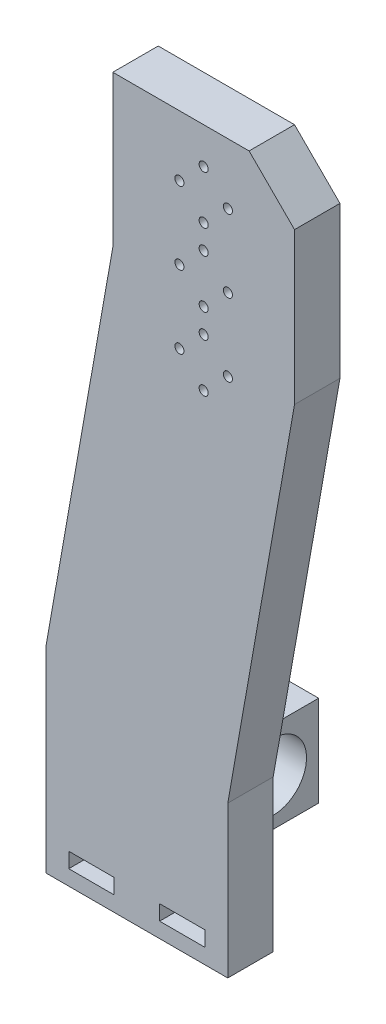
ISO-10303-21;
HEADER;
FILE_DESCRIPTION(('STEP AP214'),'2;1');
FILE_NAME('part.step','',(''),(''),'','','');
FILE_SCHEMA(('AUTOMOTIVE_DESIGN { 1 0 10303 214 1 1 1 1 }'));
ENDSEC;
DATA;
#1=APPLICATION_CONTEXT('core data for automotive mechanical design processes');
#2=APPLICATION_PROTOCOL_DEFINITION('international standard','automotive_design',2000,#1);
#3=PRODUCT_CONTEXT('',#1,'mechanical');
#4=PRODUCT('Part','Part','',(#3));
#5=PRODUCT_RELATED_PRODUCT_CATEGORY('part','',(#4));
#6=PRODUCT_DEFINITION_FORMATION('','',#4);
#7=PRODUCT_DEFINITION_CONTEXT('part definition',#1,'design');
#8=PRODUCT_DEFINITION('design','',#6,#7);
#9=PRODUCT_DEFINITION_SHAPE('','',#8);
#10=(LENGTH_UNIT() NAMED_UNIT(*) SI_UNIT(.MILLI.,.METRE.));
#11=(NAMED_UNIT(*) PLANE_ANGLE_UNIT() SI_UNIT($,.RADIAN.));
#12=(NAMED_UNIT(*) SI_UNIT($,.STERADIAN.) SOLID_ANGLE_UNIT());
#13=UNCERTAINTY_MEASURE_WITH_UNIT(LENGTH_MEASURE(1.E-05),#10,'distance_accuracy_value','');
#14=(GEOMETRIC_REPRESENTATION_CONTEXT(3) GLOBAL_UNCERTAINTY_ASSIGNED_CONTEXT((#13)) GLOBAL_UNIT_ASSIGNED_CONTEXT((#10,
#11,#12)) REPRESENTATION_CONTEXT('',''));
#15=CARTESIAN_POINT('',(0.,0.,0.));
#16=DIRECTION('',(0.,0.,1.));
#17=DIRECTION('',(1.,0.,0.));
#18=AXIS2_PLACEMENT_3D('',#15,#16,#17);
#19=CARTESIAN_POINT('',(0.,0.,0.));
#20=DIRECTION('',(0.,0.,1.));
#21=DIRECTION('',(1.,0.,0.));
#22=AXIS2_PLACEMENT_3D('',#19,#20,#21);
#23=PLANE('',#22);
#24=CARTESIAN_POINT('',(52.0408725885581,164.,0.));
#25=DIRECTION('',(0.,0.,1.));
#26=DIRECTION('',(1.,0.,0.));
#27=AXIS2_PLACEMENT_3D('',#24,#25,#26);
#28=CIRCLE('',#27,1.50000000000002);
#29=CARTESIAN_POINT('',(53.5408725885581,164.,0.));
#30=VERTEX_POINT('',#29);
#31=EDGE_CURVE('E207',#30,#30,#28,.T.);
#32=ORIENTED_EDGE('',*,*,#31,.T.);
#33=EDGE_LOOP('',(#32));
#34=FACE_BOUND('',#33,.T.);
#35=CARTESIAN_POINT('',(60.0408725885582,172.,0.));
#36=DIRECTION('',(0.,0.,1.));
#37=DIRECTION('',(1.,0.,0.));
#38=AXIS2_PLACEMENT_3D('',#35,#36,#37);
#39=CIRCLE('',#38,1.5);
#40=CARTESIAN_POINT('',(61.5408725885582,172.,0.));
#41=VERTEX_POINT('',#40);
#42=EDGE_CURVE('E217',#41,#41,#39,.T.);
#43=ORIENTED_EDGE('',*,*,#42,.T.);
#44=EDGE_LOOP('',(#43));
#45=FACE_BOUND('',#44,.T.);
#46=CARTESIAN_POINT('',(52.0408725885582,180.,0.));
#47=DIRECTION('',(0.,0.,1.));
#48=DIRECTION('',(1.,0.,0.));
#49=AXIS2_PLACEMENT_3D('',#46,#47,#48);
#50=CIRCLE('',#49,1.50000000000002);
#51=CARTESIAN_POINT('',(53.5408725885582,180.,0.));
#52=VERTEX_POINT('',#51);
#53=EDGE_CURVE('E222',#52,#52,#50,.T.);
#54=ORIENTED_EDGE('',*,*,#53,.T.);
#55=EDGE_LOOP('',(#54));
#56=FACE_BOUND('',#55,.T.);
#57=CARTESIAN_POINT('',(44.0408725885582,172.,0.));
#58=DIRECTION('',(0.,0.,1.));
#59=DIRECTION('',(1.,0.,0.));
#60=AXIS2_PLACEMENT_3D('',#57,#58,#59);
#61=CIRCLE('',#60,1.5);
#62=CARTESIAN_POINT('',(45.5408725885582,172.,0.));
#63=VERTEX_POINT('',#62);
#64=EDGE_CURVE('E228',#63,#63,#61,.T.);
#65=ORIENTED_EDGE('',*,*,#64,.T.);
#66=EDGE_LOOP('',(#65));
#67=FACE_BOUND('',#66,.T.);
#68=CARTESIAN_POINT('',(44.0408725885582,196.,0.));
#69=DIRECTION('',(0.,0.,1.));
#70=DIRECTION('',(-1.,0.,0.));
#71=AXIS2_PLACEMENT_3D('',#68,#69,#70);
#72=CIRCLE('',#71,1.5);
#73=CARTESIAN_POINT('',(42.5408725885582,196.,0.));
#74=VERTEX_POINT('',#73);
#75=EDGE_CURVE('E234',#74,#74,#72,.T.);
#76=ORIENTED_EDGE('',*,*,#75,.T.);
#77=EDGE_LOOP('',(#76));
#78=FACE_BOUND('',#77,.T.);
#79=CARTESIAN_POINT('',(52.0408725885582,188.,0.));
#80=DIRECTION('',(0.,0.,1.));
#81=DIRECTION('',(-1.,0.,0.));
#82=AXIS2_PLACEMENT_3D('',#79,#80,#81);
#83=CIRCLE('',#82,1.50000000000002);
#84=CARTESIAN_POINT('',(50.5408725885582,188.,0.));
#85=VERTEX_POINT('',#84);
#86=EDGE_CURVE('E240',#85,#85,#83,.T.);
#87=ORIENTED_EDGE('',*,*,#86,.T.);
#88=EDGE_LOOP('',(#87));
#89=FACE_BOUND('',#88,.T.);
#90=CARTESIAN_POINT('',(60.0408725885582,196.,0.));
#91=DIRECTION('',(0.,0.,1.));
#92=DIRECTION('',(-1.,0.,0.));
#93=AXIS2_PLACEMENT_3D('',#90,#91,#92);
#94=CIRCLE('',#93,1.5);
#95=CARTESIAN_POINT('',(58.5408725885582,196.,0.));
#96=VERTEX_POINT('',#95);
#97=EDGE_CURVE('E246',#96,#96,#94,.T.);
#98=ORIENTED_EDGE('',*,*,#97,.T.);
#99=EDGE_LOOP('',(#98));
#100=FACE_BOUND('',#99,.T.);
#101=CARTESIAN_POINT('',(52.0408725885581,212.,0.));
#102=DIRECTION('',(0.,0.,1.));
#103=DIRECTION('',(1.,0.,0.));
#104=AXIS2_PLACEMENT_3D('',#101,#102,#103);
#105=CIRCLE('',#104,1.50000000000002);
#106=CARTESIAN_POINT('',(53.5408725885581,212.,0.));
#107=VERTEX_POINT('',#106);
#108=EDGE_CURVE('E252',#107,#107,#105,.T.);
#109=ORIENTED_EDGE('',*,*,#108,.T.);
#110=EDGE_LOOP('',(#109));
#111=FACE_BOUND('',#110,.T.);
#112=DIRECTION('',(-1.,0.,0.));
#113=VECTOR('',#112,1.);
#114=CARTESIAN_POINT('',(52.5,10.,0.));
#115=LINE('',#114,#113);
#116=CARTESIAN_POINT('',(52.5,10.,0.));
#117=VERTEX_POINT('',#116);
#118=CARTESIAN_POINT('',(37.5,10.,0.));
#119=VERTEX_POINT('',#118);
#120=EDGE_CURVE('E258',#117,#119,#115,.T.);
#121=ORIENTED_EDGE('',*,*,#120,.T.);
#122=DIRECTION('',(0.,-1.,0.));
#123=VECTOR('',#122,1.);
#124=CARTESIAN_POINT('',(37.5,10.,0.));
#125=LINE('',#124,#123);
#126=CARTESIAN_POINT('',(37.5,5.,0.));
#127=VERTEX_POINT('',#126);
#128=EDGE_CURVE('E274',#119,#127,#125,.T.);
#129=ORIENTED_EDGE('',*,*,#128,.T.);
#130=DIRECTION('',(1.,0.,0.));
#131=VECTOR('',#130,1.);
#132=CARTESIAN_POINT('',(52.5,5.,0.));
#133=LINE('',#132,#131);
#134=CARTESIAN_POINT('',(52.5,5.,0.));
#135=VERTEX_POINT('',#134);
#136=EDGE_CURVE('E277',#127,#135,#133,.T.);
#137=ORIENTED_EDGE('',*,*,#136,.T.);
#138=DIRECTION('',(0.,1.,0.));
#139=VECTOR('',#138,1.);
#140=CARTESIAN_POINT('',(52.5,10.,0.));
#141=LINE('',#140,#139);
#142=EDGE_CURVE('E264',#135,#117,#141,.T.);
#143=ORIENTED_EDGE('',*,*,#142,.T.);
#144=EDGE_LOOP('',(#121,#129,#137,#143));
#145=FACE_BOUND('',#144,.T.);
#146=CARTESIAN_POINT('',(60.0408725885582,220.,0.));
#147=DIRECTION('',(0.,0.,1.));
#148=DIRECTION('',(1.,0.,0.));
#149=AXIS2_PLACEMENT_3D('',#146,#147,#148);
#150=CIRCLE('',#149,1.5);
#151=CARTESIAN_POINT('',(61.5408725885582,220.,0.));
#152=VERTEX_POINT('',#151);
#153=EDGE_CURVE('E322',#152,#152,#150,.T.);
#154=ORIENTED_EDGE('',*,*,#153,.T.);
#155=EDGE_LOOP('',(#154));
#156=FACE_BOUND('',#155,.T.);
#157=CARTESIAN_POINT('',(52.0408725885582,228.,0.));
#158=DIRECTION('',(0.,0.,1.));
#159=DIRECTION('',(1.,0.,0.));
#160=AXIS2_PLACEMENT_3D('',#157,#158,#159);
#161=CIRCLE('',#160,1.50000000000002);
#162=CARTESIAN_POINT('',(53.5408725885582,228.,0.));
#163=VERTEX_POINT('',#162);
#164=EDGE_CURVE('E326',#163,#163,#161,.T.);
#165=ORIENTED_EDGE('',*,*,#164,.T.);
#166=EDGE_LOOP('',(#165));
#167=FACE_BOUND('',#166,.T.);
#168=CARTESIAN_POINT('',(52.0408725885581,204.,0.));
#169=DIRECTION('',(0.,0.,1.));
#170=DIRECTION('',(-1.,0.,0.));
#171=AXIS2_PLACEMENT_3D('',#168,#169,#170);
#172=CIRCLE('',#171,1.50000000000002);
#173=CARTESIAN_POINT('',(50.5408725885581,204.,0.));
#174=VERTEX_POINT('',#173);
#175=EDGE_CURVE('E332',#174,#174,#172,.T.);
#176=ORIENTED_EDGE('',*,*,#175,.T.);
#177=EDGE_LOOP('',(#176));
#178=FACE_BOUND('',#177,.T.);
#179=CARTESIAN_POINT('',(44.0408725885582,220.,0.));
#180=DIRECTION('',(0.,0.,1.));
#181=DIRECTION('',(1.,0.,0.));
#182=AXIS2_PLACEMENT_3D('',#179,#180,#181);
#183=CIRCLE('',#182,1.5);
#184=CARTESIAN_POINT('',(45.5408725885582,220.,0.));
#185=VERTEX_POINT('',#184);
#186=EDGE_CURVE('E338',#185,#185,#183,.T.);
#187=ORIENTED_EDGE('',*,*,#186,.T.);
#188=EDGE_LOOP('',(#187));
#189=FACE_BOUND('',#188,.T.);
#190=DIRECTION('',(0.,-1.,0.));
#191=VECTOR('',#190,1.);
#192=CARTESIAN_POINT('',(0.,65.,0.));
#193=LINE('',#192,#191);
#194=CARTESIAN_POINT('',(0.,65.,0.));
#195=VERTEX_POINT('',#194);
#196=CARTESIAN_POINT('',(0.,0.,0.));
#197=VERTEX_POINT('',#196);
#198=EDGE_CURVE('E344',#195,#197,#193,.T.);
#199=ORIENTED_EDGE('',*,*,#198,.F.);
#200=DIRECTION('',(-0.173648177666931,-0.984807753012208,0.));
#201=VECTOR('',#200,1.);
#202=CARTESIAN_POINT('',(22.0408725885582,190.,0.));
#203=LINE('',#202,#201);
#204=CARTESIAN_POINT('',(22.0408725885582,190.,0.));
#205=VERTEX_POINT('',#204);
#206=EDGE_CURVE('E351',#205,#195,#203,.T.);
#207=ORIENTED_EDGE('',*,*,#206,.F.);
#208=DIRECTION('',(0.,-1.,0.));
#209=VECTOR('',#208,1.);
#210=CARTESIAN_POINT('',(22.0408725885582,240.,0.));
#211=LINE('',#210,#209);
#212=CARTESIAN_POINT('',(22.0408725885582,240.,0.));
#213=VERTEX_POINT('',#212);
#214=EDGE_CURVE('E382',#213,#205,#211,.T.);
#215=ORIENTED_EDGE('',*,*,#214,.F.);
#216=DIRECTION('',(-1.,0.,0.));
#217=VECTOR('',#216,1.);
#218=CARTESIAN_POINT('',(67.0408725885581,240.,0.));
#219=LINE('',#218,#217);
#220=CARTESIAN_POINT('',(67.0408725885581,240.,0.));
#221=VERTEX_POINT('',#220);
#222=EDGE_CURVE('E380',#221,#213,#219,.T.);
#223=ORIENTED_EDGE('',*,*,#222,.F.);
#224=DIRECTION('',(-0.707106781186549,0.707106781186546,0.));
#225=VECTOR('',#224,1.);
#226=CARTESIAN_POINT('',(82.0408725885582,225.,0.));
#227=LINE('',#226,#225);
#228=CARTESIAN_POINT('',(82.0408725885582,225.,0.));
#229=VERTEX_POINT('',#228);
#230=EDGE_CURVE('E378',#229,#221,#227,.T.);
#231=ORIENTED_EDGE('',*,*,#230,.F.);
#232=DIRECTION('',(0.,1.,0.));
#233=VECTOR('',#232,1.);
#234=CARTESIAN_POINT('',(82.0408725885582,175.,0.));
#235=LINE('',#234,#233);
#236=CARTESIAN_POINT('',(82.0408725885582,175.,0.));
#237=VERTEX_POINT('',#236);
#238=EDGE_CURVE('E376',#237,#229,#235,.T.);
#239=ORIENTED_EDGE('',*,*,#238,.F.);
#240=DIRECTION('',(0.173648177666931,0.984807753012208,0.));
#241=VECTOR('',#240,1.);
#242=CARTESIAN_POINT('',(60.,50.,0.));
#243=LINE('',#242,#241);
#244=CARTESIAN_POINT('',(60.,50.,0.));
#245=VERTEX_POINT('',#244);
#246=EDGE_CURVE('E374',#245,#237,#243,.T.);
#247=ORIENTED_EDGE('',*,*,#246,.F.);
#248=DIRECTION('',(0.,1.,0.));
#249=VECTOR('',#248,1.);
#250=CARTESIAN_POINT('',(60.,0.,0.));
#251=LINE('',#250,#249);
#252=CARTESIAN_POINT('',(60.,0.,0.));
#253=VERTEX_POINT('',#252);
#254=EDGE_CURVE('E372',#253,#245,#251,.T.);
#255=ORIENTED_EDGE('',*,*,#254,.F.);
#256=DIRECTION('',(1.,0.,0.));
#257=VECTOR('',#256,1.);
#258=CARTESIAN_POINT('',(0.,0.,0.));
#259=LINE('',#258,#257);
#260=EDGE_CURVE('E370',#197,#253,#259,.T.);
#261=ORIENTED_EDGE('',*,*,#260,.F.);
#262=EDGE_LOOP('',(#199,#207,#215,#223,#231,#239,#247,#255,#261));
#263=FACE_BOUND('',#262,.T.);
#264=DIRECTION('',(0.,-1.,0.));
#265=VECTOR('',#264,1.);
#266=CARTESIAN_POINT('',(7.50000000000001,10.,0.));
#267=LINE('',#266,#265);
#268=CARTESIAN_POINT('',(7.50000000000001,10.,0.));
#269=VERTEX_POINT('',#268);
#270=CARTESIAN_POINT('',(7.50000000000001,5.,0.));
#271=VERTEX_POINT('',#270);
#272=EDGE_CURVE('E291',#269,#271,#267,.T.);
#273=ORIENTED_EDGE('',*,*,#272,.T.);
#274=DIRECTION('',(1.,0.,0.));
#275=VECTOR('',#274,1.);
#276=CARTESIAN_POINT('',(7.50000000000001,5.,0.));
#277=LINE('',#276,#275);
#278=CARTESIAN_POINT('',(22.5,5.,0.));
#279=VERTEX_POINT('',#278);
#280=EDGE_CURVE('E305',#271,#279,#277,.T.);
#281=ORIENTED_EDGE('',*,*,#280,.T.);
#282=DIRECTION('',(0.,1.,0.));
#283=VECTOR('',#282,1.);
#284=CARTESIAN_POINT('',(22.5,10.,0.));
#285=LINE('',#284,#283);
#286=CARTESIAN_POINT('',(22.5,10.,0.));
#287=VERTEX_POINT('',#286);
#288=EDGE_CURVE('E308',#279,#287,#285,.T.);
#289=ORIENTED_EDGE('',*,*,#288,.T.);
#290=DIRECTION('',(-1.,0.,0.));
#291=VECTOR('',#290,1.);
#292=CARTESIAN_POINT('',(7.50000000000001,10.,0.));
#293=LINE('',#292,#291);
#294=EDGE_CURVE('E295',#287,#269,#293,.T.);
#295=ORIENTED_EDGE('',*,*,#294,.T.);
#296=EDGE_LOOP('',(#273,#281,#289,#295));
#297=FACE_BOUND('',#296,.T.);
#298=DIRECTION('',(0.,-1.,0.));
#299=VECTOR('',#298,1.);
#300=CARTESIAN_POINT('',(45.,50.,0.));
#301=LINE('',#300,#299);
#302=CARTESIAN_POINT('',(45.,50.,0.));
#303=VERTEX_POINT('',#302);
#304=CARTESIAN_POINT('',(45.,20.,0.));
#305=VERTEX_POINT('',#304);
#306=EDGE_CURVE('E206',#303,#305,#301,.T.);
#307=ORIENTED_EDGE('',*,*,#306,.F.);
#308=DIRECTION('',(1.,0.,0.));
#309=VECTOR('',#308,1.);
#310=CARTESIAN_POINT('',(45.,50.,0.));
#311=LINE('',#310,#309);
#312=CARTESIAN_POINT('',(15.,50.,0.));
#313=VERTEX_POINT('',#312);
#314=EDGE_CURVE('E203',#313,#303,#311,.T.);
#315=ORIENTED_EDGE('',*,*,#314,.F.);
#316=DIRECTION('',(0.,1.,0.));
#317=VECTOR('',#316,1.);
#318=CARTESIAN_POINT('',(15.,50.,0.));
#319=LINE('',#318,#317);
#320=CARTESIAN_POINT('',(15.,20.,0.));
#321=VERTEX_POINT('',#320);
#322=EDGE_CURVE('E63',#321,#313,#319,.T.);
#323=ORIENTED_EDGE('',*,*,#322,.F.);
#324=DIRECTION('',(-1.,0.,0.));
#325=VECTOR('',#324,1.);
#326=CARTESIAN_POINT('',(45.,20.,0.));
#327=LINE('',#326,#325);
#328=EDGE_CURVE('E58',#305,#321,#327,.T.);
#329=ORIENTED_EDGE('',*,*,#328,.F.);
#330=EDGE_LOOP('',(#307,#315,#323,#329));
#331=FACE_BOUND('',#330,.T.);
#332=ADVANCED_FACE('F43',(#34,#45,#56,#67,#78,#89,#100,#111,#145,#156,#167,#178,#189,#263,#297,
#331),#23,.F.);
#333=CARTESIAN_POINT('',(0.,0.,15.));
#334=DIRECTION('',(0.,0.,1.));
#335=DIRECTION('',(1.,0.,0.));
#336=AXIS2_PLACEMENT_3D('',#333,#334,#335);
#337=PLANE('',#336);
#338=CARTESIAN_POINT('',(60.0408725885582,172.,15.));
#339=DIRECTION('',(0.,0.,1.));
#340=DIRECTION('',(1.,0.,0.));
#341=AXIS2_PLACEMENT_3D('',#338,#339,#340);
#342=CIRCLE('',#341,1.5);
#343=CARTESIAN_POINT('',(61.5408725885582,172.,15.));
#344=VERTEX_POINT('',#343);
#345=EDGE_CURVE('E219',#344,#344,#342,.T.);
#346=ORIENTED_EDGE('',*,*,#345,.F.);
#347=EDGE_LOOP('',(#346));
#348=FACE_BOUND('',#347,.T.);
#349=CARTESIAN_POINT('',(44.0408725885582,172.,15.));
#350=DIRECTION('',(0.,0.,1.));
#351=DIRECTION('',(1.,0.,0.));
#352=AXIS2_PLACEMENT_3D('',#349,#350,#351);
#353=CIRCLE('',#352,1.5);
#354=CARTESIAN_POINT('',(45.5408725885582,172.,15.));
#355=VERTEX_POINT('',#354);
#356=EDGE_CURVE('E231',#355,#355,#353,.T.);
#357=ORIENTED_EDGE('',*,*,#356,.F.);
#358=EDGE_LOOP('',(#357));
#359=FACE_BOUND('',#358,.T.);
#360=CARTESIAN_POINT('',(52.0408725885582,188.,15.));
#361=DIRECTION('',(0.,0.,1.));
#362=DIRECTION('',(-1.,0.,0.));
#363=AXIS2_PLACEMENT_3D('',#360,#361,#362);
#364=CIRCLE('',#363,1.50000000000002);
#365=CARTESIAN_POINT('',(50.5408725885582,188.,15.));
#366=VERTEX_POINT('',#365);
#367=EDGE_CURVE('E243',#366,#366,#364,.T.);
#368=ORIENTED_EDGE('',*,*,#367,.F.);
#369=EDGE_LOOP('',(#368));
#370=FACE_BOUND('',#369,.T.);
#371=CARTESIAN_POINT('',(52.0408725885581,212.,15.));
#372=DIRECTION('',(0.,0.,1.));
#373=DIRECTION('',(1.,0.,0.));
#374=AXIS2_PLACEMENT_3D('',#371,#372,#373);
#375=CIRCLE('',#374,1.50000000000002);
#376=CARTESIAN_POINT('',(53.5408725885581,212.,15.));
#377=VERTEX_POINT('',#376);
#378=EDGE_CURVE('E255',#377,#377,#375,.T.);
#379=ORIENTED_EDGE('',*,*,#378,.F.);
#380=EDGE_LOOP('',(#379));
#381=FACE_BOUND('',#380,.T.);
#382=CARTESIAN_POINT('',(52.0408725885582,228.,15.));
#383=DIRECTION('',(0.,0.,1.));
#384=DIRECTION('',(1.,0.,0.));
#385=AXIS2_PLACEMENT_3D('',#382,#383,#384);
#386=CIRCLE('',#385,1.50000000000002);
#387=CARTESIAN_POINT('',(53.5408725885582,228.,15.));
#388=VERTEX_POINT('',#387);
#389=EDGE_CURVE('E329',#388,#388,#386,.T.);
#390=ORIENTED_EDGE('',*,*,#389,.F.);
#391=EDGE_LOOP('',(#390));
#392=FACE_BOUND('',#391,.T.);
#393=CARTESIAN_POINT('',(44.0408725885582,220.,15.));
#394=DIRECTION('',(0.,0.,1.));
#395=DIRECTION('',(1.,0.,0.));
#396=AXIS2_PLACEMENT_3D('',#393,#394,#395);
#397=CIRCLE('',#396,1.5);
#398=CARTESIAN_POINT('',(45.5408725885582,220.,15.));
#399=VERTEX_POINT('',#398);
#400=EDGE_CURVE('E341',#399,#399,#397,.T.);
#401=ORIENTED_EDGE('',*,*,#400,.F.);
#402=EDGE_LOOP('',(#401));
#403=FACE_BOUND('',#402,.T.);
#404=DIRECTION('',(0.,-1.,0.));
#405=VECTOR('',#404,1.);
#406=CARTESIAN_POINT('',(0.,65.,15.));
#407=LINE('',#406,#405);
#408=CARTESIAN_POINT('',(0.,65.,15.));
#409=VERTEX_POINT('',#408);
#410=CARTESIAN_POINT('',(0.,0.,15.));
#411=VERTEX_POINT('',#410);
#412=EDGE_CURVE('E347',#409,#411,#407,.T.);
#413=ORIENTED_EDGE('',*,*,#412,.T.);
#414=DIRECTION('',(1.,0.,0.));
#415=VECTOR('',#414,1.);
#416=CARTESIAN_POINT('',(0.,0.,15.));
#417=LINE('',#416,#415);
#418=CARTESIAN_POINT('',(60.,0.,15.));
#419=VERTEX_POINT('',#418);
#420=EDGE_CURVE('E350',#411,#419,#417,.T.);
#421=ORIENTED_EDGE('',*,*,#420,.T.);
#422=DIRECTION('',(0.,1.,0.));
#423=VECTOR('',#422,1.);
#424=CARTESIAN_POINT('',(60.,0.,15.));
#425=LINE('',#424,#423);
#426=CARTESIAN_POINT('',(60.,50.,15.));
#427=VERTEX_POINT('',#426);
#428=EDGE_CURVE('E353',#419,#427,#425,.T.);
#429=ORIENTED_EDGE('',*,*,#428,.T.);
#430=DIRECTION('',(0.173648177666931,0.984807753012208,0.));
#431=VECTOR('',#430,1.);
#432=CARTESIAN_POINT('',(60.,50.,15.));
#433=LINE('',#432,#431);
#434=CARTESIAN_POINT('',(82.0408725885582,175.,15.));
#435=VERTEX_POINT('',#434);
#436=EDGE_CURVE('E355',#427,#435,#433,.T.);
#437=ORIENTED_EDGE('',*,*,#436,.T.);
#438=DIRECTION('',(0.,1.,0.));
#439=VECTOR('',#438,1.);
#440=CARTESIAN_POINT('',(82.0408725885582,175.,15.));
#441=LINE('',#440,#439);
#442=CARTESIAN_POINT('',(82.0408725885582,225.,15.));
#443=VERTEX_POINT('',#442);
#444=EDGE_CURVE('E357',#435,#443,#441,.T.);
#445=ORIENTED_EDGE('',*,*,#444,.T.);
#446=DIRECTION('',(-0.707106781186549,0.707106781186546,0.));
#447=VECTOR('',#446,1.);
#448=CARTESIAN_POINT('',(82.0408725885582,225.,15.));
#449=LINE('',#448,#447);
#450=CARTESIAN_POINT('',(67.0408725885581,240.,15.));
#451=VERTEX_POINT('',#450);
#452=EDGE_CURVE('E359',#443,#451,#449,.T.);
#453=ORIENTED_EDGE('',*,*,#452,.T.);
#454=DIRECTION('',(-1.,0.,0.));
#455=VECTOR('',#454,1.);
#456=CARTESIAN_POINT('',(67.0408725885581,240.,15.));
#457=LINE('',#456,#455);
#458=CARTESIAN_POINT('',(22.0408725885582,240.,15.));
#459=VERTEX_POINT('',#458);
#460=EDGE_CURVE('E361',#451,#459,#457,.T.);
#461=ORIENTED_EDGE('',*,*,#460,.T.);
#462=DIRECTION('',(0.,-1.,0.));
#463=VECTOR('',#462,1.);
#464=CARTESIAN_POINT('',(22.0408725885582,240.,15.));
#465=LINE('',#464,#463);
#466=CARTESIAN_POINT('',(22.0408725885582,190.,15.));
#467=VERTEX_POINT('',#466);
#468=EDGE_CURVE('E363',#459,#467,#465,.T.);
#469=ORIENTED_EDGE('',*,*,#468,.T.);
#470=DIRECTION('',(-0.173648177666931,-0.984807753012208,0.));
#471=VECTOR('',#470,1.);
#472=CARTESIAN_POINT('',(22.0408725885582,190.,15.));
#473=LINE('',#472,#471);
#474=EDGE_CURVE('E365',#467,#409,#473,.T.);
#475=ORIENTED_EDGE('',*,*,#474,.T.);
#476=EDGE_LOOP('',(#413,#421,#429,#437,#445,#453,#461,#469,#475));
#477=FACE_BOUND('',#476,.T.);
#478=CARTESIAN_POINT('',(52.0408725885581,204.,15.));
#479=DIRECTION('',(0.,0.,1.));
#480=DIRECTION('',(-1.,0.,0.));
#481=AXIS2_PLACEMENT_3D('',#478,#479,#480);
#482=CIRCLE('',#481,1.50000000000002);
#483=CARTESIAN_POINT('',(50.5408725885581,204.,15.));
#484=VERTEX_POINT('',#483);
#485=EDGE_CURVE('E335',#484,#484,#482,.T.);
#486=ORIENTED_EDGE('',*,*,#485,.F.);
#487=EDGE_LOOP('',(#486));
#488=FACE_BOUND('',#487,.T.);
#489=CARTESIAN_POINT('',(60.0408725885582,220.,15.));
#490=DIRECTION('',(0.,0.,1.));
#491=DIRECTION('',(1.,0.,0.));
#492=AXIS2_PLACEMENT_3D('',#489,#490,#491);
#493=CIRCLE('',#492,1.5);
#494=CARTESIAN_POINT('',(61.5408725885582,220.,15.));
#495=VERTEX_POINT('',#494);
#496=EDGE_CURVE('E323',#495,#495,#493,.T.);
#497=ORIENTED_EDGE('',*,*,#496,.F.);
#498=EDGE_LOOP('',(#497));
#499=FACE_BOUND('',#498,.T.);
#500=DIRECTION('',(1.,0.,0.));
#501=VECTOR('',#500,1.);
#502=CARTESIAN_POINT('',(7.50000000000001,5.,15.));
#503=LINE('',#502,#501);
#504=CARTESIAN_POINT('',(7.50000000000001,5.,15.));
#505=VERTEX_POINT('',#504);
#506=CARTESIAN_POINT('',(22.5,5.,15.));
#507=VERTEX_POINT('',#506);
#508=EDGE_CURVE('E294',#505,#507,#503,.T.);
#509=ORIENTED_EDGE('',*,*,#508,.F.);
#510=DIRECTION('',(0.,-1.,0.));
#511=VECTOR('',#510,1.);
#512=CARTESIAN_POINT('',(7.50000000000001,10.,15.));
#513=LINE('',#512,#511);
#514=CARTESIAN_POINT('',(7.50000000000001,10.,15.));
#515=VERTEX_POINT('',#514);
#516=EDGE_CURVE('E292',#515,#505,#513,.T.);
#517=ORIENTED_EDGE('',*,*,#516,.F.);
#518=DIRECTION('',(-1.,0.,0.));
#519=VECTOR('',#518,1.);
#520=CARTESIAN_POINT('',(7.50000000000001,10.,15.));
#521=LINE('',#520,#519);
#522=CARTESIAN_POINT('',(22.5,10.,15.));
#523=VERTEX_POINT('',#522);
#524=EDGE_CURVE('E300',#523,#515,#521,.T.);
#525=ORIENTED_EDGE('',*,*,#524,.F.);
#526=DIRECTION('',(0.,1.,0.));
#527=VECTOR('',#526,1.);
#528=CARTESIAN_POINT('',(22.5,10.,15.));
#529=LINE('',#528,#527);
#530=EDGE_CURVE('E297',#507,#523,#529,.T.);
#531=ORIENTED_EDGE('',*,*,#530,.F.);
#532=EDGE_LOOP('',(#509,#517,#525,#531));
#533=FACE_BOUND('',#532,.T.);
#534=DIRECTION('',(0.,-1.,0.));
#535=VECTOR('',#534,1.);
#536=CARTESIAN_POINT('',(37.5,10.,15.));
#537=LINE('',#536,#535);
#538=CARTESIAN_POINT('',(37.5,10.,15.));
#539=VERTEX_POINT('',#538);
#540=CARTESIAN_POINT('',(37.5,5.,15.));
#541=VERTEX_POINT('',#540);
#542=EDGE_CURVE('E263',#539,#541,#537,.T.);
#543=ORIENTED_EDGE('',*,*,#542,.F.);
#544=DIRECTION('',(-1.,0.,0.));
#545=VECTOR('',#544,1.);
#546=CARTESIAN_POINT('',(52.5,10.,15.));
#547=LINE('',#546,#545);
#548=CARTESIAN_POINT('',(52.5,10.,15.));
#549=VERTEX_POINT('',#548);
#550=EDGE_CURVE('E261',#549,#539,#547,.T.);
#551=ORIENTED_EDGE('',*,*,#550,.F.);
#552=DIRECTION('',(0.,1.,0.));
#553=VECTOR('',#552,1.);
#554=CARTESIAN_POINT('',(52.5,10.,15.));
#555=LINE('',#554,#553);
#556=CARTESIAN_POINT('',(52.5,5.,15.));
#557=VERTEX_POINT('',#556);
#558=EDGE_CURVE('E269',#557,#549,#555,.T.);
#559=ORIENTED_EDGE('',*,*,#558,.F.);
#560=DIRECTION('',(1.,0.,0.));
#561=VECTOR('',#560,1.);
#562=CARTESIAN_POINT('',(52.5,5.,15.));
#563=LINE('',#562,#561);
#564=EDGE_CURVE('E266',#541,#557,#563,.T.);
#565=ORIENTED_EDGE('',*,*,#564,.F.);
#566=EDGE_LOOP('',(#543,#551,#559,#565));
#567=FACE_BOUND('',#566,.T.);
#568=CARTESIAN_POINT('',(60.0408725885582,196.,15.));
#569=DIRECTION('',(0.,0.,1.));
#570=DIRECTION('',(-1.,0.,0.));
#571=AXIS2_PLACEMENT_3D('',#568,#569,#570);
#572=CIRCLE('',#571,1.5);
#573=CARTESIAN_POINT('',(58.5408725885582,196.,15.));
#574=VERTEX_POINT('',#573);
#575=EDGE_CURVE('E249',#574,#574,#572,.T.);
#576=ORIENTED_EDGE('',*,*,#575,.F.);
#577=EDGE_LOOP('',(#576));
#578=FACE_BOUND('',#577,.T.);
#579=CARTESIAN_POINT('',(44.0408725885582,196.,15.));
#580=DIRECTION('',(0.,0.,1.));
#581=DIRECTION('',(-1.,0.,0.));
#582=AXIS2_PLACEMENT_3D('',#579,#580,#581);
#583=CIRCLE('',#582,1.5);
#584=CARTESIAN_POINT('',(42.5408725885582,196.,15.));
#585=VERTEX_POINT('',#584);
#586=EDGE_CURVE('E237',#585,#585,#583,.T.);
#587=ORIENTED_EDGE('',*,*,#586,.F.);
#588=EDGE_LOOP('',(#587));
#589=FACE_BOUND('',#588,.T.);
#590=CARTESIAN_POINT('',(52.0408725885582,180.,15.));
#591=DIRECTION('',(0.,0.,1.));
#592=DIRECTION('',(1.,0.,0.));
#593=AXIS2_PLACEMENT_3D('',#590,#591,#592);
#594=CIRCLE('',#593,1.50000000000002);
#595=CARTESIAN_POINT('',(53.5408725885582,180.,15.));
#596=VERTEX_POINT('',#595);
#597=EDGE_CURVE('E225',#596,#596,#594,.T.);
#598=ORIENTED_EDGE('',*,*,#597,.F.);
#599=EDGE_LOOP('',(#598));
#600=FACE_BOUND('',#599,.T.);
#601=CARTESIAN_POINT('',(52.0408725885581,164.,15.));
#602=DIRECTION('',(0.,0.,1.));
#603=DIRECTION('',(1.,0.,0.));
#604=AXIS2_PLACEMENT_3D('',#601,#602,#603);
#605=CIRCLE('',#604,1.50000000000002);
#606=CARTESIAN_POINT('',(53.5408725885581,164.,15.));
#607=VERTEX_POINT('',#606);
#608=EDGE_CURVE('E210',#607,#607,#605,.T.);
#609=ORIENTED_EDGE('',*,*,#608,.F.);
#610=EDGE_LOOP('',(#609));
#611=FACE_BOUND('',#610,.T.);
#612=ADVANCED_FACE('F428',(#348,#359,#370,#381,#392,#403,#477,#488,#499,#533,#567,#578,#589,
#600,#611),#337,.T.);
#613=CARTESIAN_POINT('',(0.,65.,15.));
#614=DIRECTION('',(1.,0.,0.));
#615=DIRECTION('',(0.,1.,0.));
#616=AXIS2_PLACEMENT_3D('',#613,#614,#615);
#617=PLANE('',#616);
#618=ORIENTED_EDGE('',*,*,#198,.T.);
#619=DIRECTION('',(0.,0.,-1.));
#620=VECTOR('',#619,1.);
#621=CARTESIAN_POINT('',(0.,0.,15.));
#622=LINE('',#621,#620);
#623=EDGE_CURVE('E11',#411,#197,#622,.T.);
#624=ORIENTED_EDGE('',*,*,#623,.F.);
#625=ORIENTED_EDGE('',*,*,#412,.F.);
#626=DIRECTION('',(0.,0.,-1.));
#627=VECTOR('',#626,1.);
#628=CARTESIAN_POINT('',(0.,65.,15.));
#629=LINE('',#628,#627);
#630=EDGE_CURVE('E367',#409,#195,#629,.T.);
#631=ORIENTED_EDGE('',*,*,#630,.T.);
#632=EDGE_LOOP('',(#618,#624,#625,#631));
#633=FACE_BOUND('',#632,.T.);
#634=ADVANCED_FACE('F45',(#633),#617,.F.);
#635=CARTESIAN_POINT('',(0.,0.,15.));
#636=DIRECTION('',(0.,1.,0.));
#637=DIRECTION('',(0.,0.,1.));
#638=AXIS2_PLACEMENT_3D('',#635,#636,#637);
#639=PLANE('',#638);
#640=ORIENTED_EDGE('',*,*,#260,.T.);
#641=DIRECTION('',(0.,0.,-1.));
#642=VECTOR('',#641,1.);
#643=CARTESIAN_POINT('',(60.,0.,15.));
#644=LINE('',#643,#642);
#645=EDGE_CURVE('E51',#419,#253,#644,.T.);
#646=ORIENTED_EDGE('',*,*,#645,.F.);
#647=ORIENTED_EDGE('',*,*,#420,.F.);
#648=ORIENTED_EDGE('',*,*,#623,.T.);
#649=EDGE_LOOP('',(#640,#646,#647,#648));
#650=FACE_BOUND('',#649,.T.);
#651=ADVANCED_FACE('F433',(#650),#639,.F.);
#652=CARTESIAN_POINT('',(60.,0.,15.));
#653=DIRECTION('',(-1.,0.,0.));
#654=DIRECTION('',(0.,0.,1.));
#655=AXIS2_PLACEMENT_3D('',#652,#653,#654);
#656=PLANE('',#655);
#657=ORIENTED_EDGE('',*,*,#254,.T.);
#658=DIRECTION('',(0.,0.,-1.));
#659=VECTOR('',#658,1.);
#660=CARTESIAN_POINT('',(60.,50.,15.));
#661=LINE('',#660,#659);
#662=EDGE_CURVE('E402',#427,#245,#661,.T.);
#663=ORIENTED_EDGE('',*,*,#662,.F.);
#664=ORIENTED_EDGE('',*,*,#428,.F.);
#665=ORIENTED_EDGE('',*,*,#645,.T.);
#666=EDGE_LOOP('',(#657,#663,#664,#665));
#667=FACE_BOUND('',#666,.T.);
#668=ADVANCED_FACE('F409',(#667),#656,.F.);
#669=CARTESIAN_POINT('',(60.,50.,15.));
#670=DIRECTION('',(-0.984807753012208,0.173648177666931,0.));
#671=DIRECTION('',(-0.173648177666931,-0.984807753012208,0.));
#672=AXIS2_PLACEMENT_3D('',#669,#670,#671);
#673=PLANE('',#672);
#674=ORIENTED_EDGE('',*,*,#246,.T.);
#675=DIRECTION('',(0.,0.,-1.));
#676=VECTOR('',#675,1.);
#677=CARTESIAN_POINT('',(82.0408725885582,175.,15.));
#678=LINE('',#677,#676);
#679=EDGE_CURVE('E399',#435,#237,#678,.T.);
#680=ORIENTED_EDGE('',*,*,#679,.F.);
#681=ORIENTED_EDGE('',*,*,#436,.F.);
#682=ORIENTED_EDGE('',*,*,#662,.T.);
#683=EDGE_LOOP('',(#674,#680,#681,#682));
#684=FACE_BOUND('',#683,.T.);
#685=ADVANCED_FACE('F420',(#684),#673,.F.);
#686=CARTESIAN_POINT('',(82.0408725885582,175.,15.));
#687=DIRECTION('',(-1.,0.,0.));
#688=DIRECTION('',(0.,0.,1.));
#689=AXIS2_PLACEMENT_3D('',#686,#687,#688);
#690=PLANE('',#689);
#691=ORIENTED_EDGE('',*,*,#238,.T.);
#692=DIRECTION('',(0.,0.,-1.));
#693=VECTOR('',#692,1.);
#694=CARTESIAN_POINT('',(82.0408725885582,225.,15.));
#695=LINE('',#694,#693);
#696=EDGE_CURVE('E396',#443,#229,#695,.T.);
#697=ORIENTED_EDGE('',*,*,#696,.F.);
#698=ORIENTED_EDGE('',*,*,#444,.F.);
#699=ORIENTED_EDGE('',*,*,#679,.T.);
#700=EDGE_LOOP('',(#691,#697,#698,#699));
#701=FACE_BOUND('',#700,.T.);
#702=ADVANCED_FACE('F424',(#701),#690,.F.);
#703=CARTESIAN_POINT('',(82.0408725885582,225.,15.));
#704=DIRECTION('',(-0.707106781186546,-0.707106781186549,0.));
#705=DIRECTION('',(0.707106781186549,-0.707106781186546,0.));
#706=AXIS2_PLACEMENT_3D('',#703,#704,#705);
#707=PLANE('',#706);
#708=ORIENTED_EDGE('',*,*,#230,.T.);
#709=DIRECTION('',(0.,0.,-1.));
#710=VECTOR('',#709,1.);
#711=CARTESIAN_POINT('',(67.0408725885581,240.,15.));
#712=LINE('',#711,#710);
#713=EDGE_CURVE('E393',#451,#221,#712,.T.);
#714=ORIENTED_EDGE('',*,*,#713,.F.);
#715=ORIENTED_EDGE('',*,*,#452,.F.);
#716=ORIENTED_EDGE('',*,*,#696,.T.);
#717=EDGE_LOOP('',(#708,#714,#715,#716));
#718=FACE_BOUND('',#717,.T.);
#719=ADVANCED_FACE('F451',(#718),#707,.F.);
#720=CARTESIAN_POINT('',(67.0408725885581,240.,15.));
#721=DIRECTION('',(0.,-1.,0.));
#722=DIRECTION('',(0.,0.,-1.));
#723=AXIS2_PLACEMENT_3D('',#720,#721,#722);
#724=PLANE('',#723);
#725=ORIENTED_EDGE('',*,*,#222,.T.);
#726=DIRECTION('',(0.,0.,-1.));
#727=VECTOR('',#726,1.);
#728=CARTESIAN_POINT('',(22.0408725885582,240.,15.));
#729=LINE('',#728,#727);
#730=EDGE_CURVE('E390',#459,#213,#729,.T.);
#731=ORIENTED_EDGE('',*,*,#730,.F.);
#732=ORIENTED_EDGE('',*,*,#460,.F.);
#733=ORIENTED_EDGE('',*,*,#713,.T.);
#734=EDGE_LOOP('',(#725,#731,#732,#733));
#735=FACE_BOUND('',#734,.T.);
#736=ADVANCED_FACE('F449',(#735),#724,.F.);
#737=CARTESIAN_POINT('',(22.0408725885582,240.,15.));
#738=DIRECTION('',(1.,0.,0.));
#739=DIRECTION('',(0.,1.,0.));
#740=AXIS2_PLACEMENT_3D('',#737,#738,#739);
#741=PLANE('',#740);
#742=ORIENTED_EDGE('',*,*,#214,.T.);
#743=DIRECTION('',(0.,0.,-1.));
#744=VECTOR('',#743,1.);
#745=CARTESIAN_POINT('',(22.0408725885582,190.,15.));
#746=LINE('',#745,#744);
#747=EDGE_CURVE('E387',#467,#205,#746,.T.);
#748=ORIENTED_EDGE('',*,*,#747,.F.);
#749=ORIENTED_EDGE('',*,*,#468,.F.);
#750=ORIENTED_EDGE('',*,*,#730,.T.);
#751=EDGE_LOOP('',(#742,#748,#749,#750));
#752=FACE_BOUND('',#751,.T.);
#753=ADVANCED_FACE('F445',(#752),#741,.F.);
#754=CARTESIAN_POINT('',(22.0408725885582,190.,15.));
#755=DIRECTION('',(0.984807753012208,-0.173648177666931,0.));
#756=DIRECTION('',(0.173648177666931,0.984807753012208,0.));
#757=AXIS2_PLACEMENT_3D('',#754,#755,#756);
#758=PLANE('',#757);
#759=ORIENTED_EDGE('',*,*,#206,.T.);
#760=ORIENTED_EDGE('',*,*,#630,.F.);
#761=ORIENTED_EDGE('',*,*,#474,.F.);
#762=ORIENTED_EDGE('',*,*,#747,.T.);
#763=EDGE_LOOP('',(#759,#760,#761,#762));
#764=FACE_BOUND('',#763,.T.);
#765=ADVANCED_FACE('F440',(#764),#758,.F.);
#766=CARTESIAN_POINT('',(44.0408725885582,220.,15.));
#767=DIRECTION('',(0.,0.,-1.));
#768=DIRECTION('',(-1.,0.,0.));
#769=AXIS2_PLACEMENT_3D('',#766,#767,#768);
#770=CYLINDRICAL_SURFACE('',#769,1.5);
#771=ORIENTED_EDGE('',*,*,#400,.T.);
#772=EDGE_LOOP('',(#771));
#773=FACE_BOUND('',#772,.T.);
#774=ORIENTED_EDGE('',*,*,#186,.F.);
#775=EDGE_LOOP('',(#774));
#776=FACE_BOUND('',#775,.T.);
#777=ADVANCED_FACE('F475',(#773,#776),#770,.F.);
#778=CARTESIAN_POINT('',(52.0408725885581,204.,15.));
#779=DIRECTION('',(0.,0.,-1.));
#780=DIRECTION('',(-1.,0.,0.));
#781=AXIS2_PLACEMENT_3D('',#778,#779,#780);
#782=CYLINDRICAL_SURFACE('',#781,1.50000000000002);
#783=ORIENTED_EDGE('',*,*,#485,.T.);
#784=EDGE_LOOP('',(#783));
#785=FACE_BOUND('',#784,.T.);
#786=ORIENTED_EDGE('',*,*,#175,.F.);
#787=EDGE_LOOP('',(#786));
#788=FACE_BOUND('',#787,.T.);
#789=ADVANCED_FACE('F493',(#785,#788),#782,.F.);
#790=CARTESIAN_POINT('',(52.0408725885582,228.,15.));
#791=DIRECTION('',(0.,0.,-1.));
#792=DIRECTION('',(-1.,0.,0.));
#793=AXIS2_PLACEMENT_3D('',#790,#791,#792);
#794=CYLINDRICAL_SURFACE('',#793,1.50000000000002);
#795=ORIENTED_EDGE('',*,*,#389,.T.);
#796=EDGE_LOOP('',(#795));
#797=FACE_BOUND('',#796,.T.);
#798=ORIENTED_EDGE('',*,*,#164,.F.);
#799=EDGE_LOOP('',(#798));
#800=FACE_BOUND('',#799,.T.);
#801=ADVANCED_FACE('F501',(#797,#800),#794,.F.);
#802=CARTESIAN_POINT('',(60.0408725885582,220.,15.));
#803=DIRECTION('',(0.,0.,-1.));
#804=DIRECTION('',(-1.,0.,0.));
#805=AXIS2_PLACEMENT_3D('',#802,#803,#804);
#806=CYLINDRICAL_SURFACE('',#805,1.5);
#807=ORIENTED_EDGE('',*,*,#496,.T.);
#808=EDGE_LOOP('',(#807));
#809=FACE_BOUND('',#808,.T.);
#810=ORIENTED_EDGE('',*,*,#153,.F.);
#811=EDGE_LOOP('',(#810));
#812=FACE_BOUND('',#811,.T.);
#813=ADVANCED_FACE('F510',(#809,#812),#806,.F.);
#814=CARTESIAN_POINT('',(7.50000000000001,10.,15.));
#815=DIRECTION('',(1.,0.,0.));
#816=DIRECTION('',(0.,0.,-1.));
#817=AXIS2_PLACEMENT_3D('',#814,#815,#816);
#818=PLANE('',#817);
#819=ORIENTED_EDGE('',*,*,#272,.F.);
#820=DIRECTION('',(0.,0.,-1.));
#821=VECTOR('',#820,1.);
#822=CARTESIAN_POINT('',(7.50000000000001,10.,15.));
#823=LINE('',#822,#821);
#824=EDGE_CURVE('E302',#515,#269,#823,.T.);
#825=ORIENTED_EDGE('',*,*,#824,.F.);
#826=ORIENTED_EDGE('',*,*,#516,.T.);
#827=DIRECTION('',(0.,0.,-1.));
#828=VECTOR('',#827,1.);
#829=CARTESIAN_POINT('',(7.50000000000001,5.,15.));
#830=LINE('',#829,#828);
#831=EDGE_CURVE('E319',#505,#271,#830,.T.);
#832=ORIENTED_EDGE('',*,*,#831,.T.);
#833=EDGE_LOOP('',(#819,#825,#826,#832));
#834=FACE_BOUND('',#833,.T.);
#835=ADVANCED_FACE('F519',(#834),#818,.T.);
#836=CARTESIAN_POINT('',(7.50000000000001,5.,15.));
#837=DIRECTION('',(0.,1.,0.));
#838=DIRECTION('',(0.,0.,1.));
#839=AXIS2_PLACEMENT_3D('',#836,#837,#838);
#840=PLANE('',#839);
#841=ORIENTED_EDGE('',*,*,#280,.F.);
#842=ORIENTED_EDGE('',*,*,#831,.F.);
#843=ORIENTED_EDGE('',*,*,#508,.T.);
#844=DIRECTION('',(0.,0.,-1.));
#845=VECTOR('',#844,1.);
#846=CARTESIAN_POINT('',(22.5,5.,15.));
#847=LINE('',#846,#845);
#848=EDGE_CURVE('E317',#507,#279,#847,.T.);
#849=ORIENTED_EDGE('',*,*,#848,.T.);
#850=EDGE_LOOP('',(#841,#842,#843,#849));
#851=FACE_BOUND('',#850,.T.);
#852=ADVANCED_FACE('F528',(#851),#840,.T.);
#853=CARTESIAN_POINT('',(22.5,10.,15.));
#854=DIRECTION('',(-1.,0.,0.));
#855=DIRECTION('',(0.,-1.,0.));
#856=AXIS2_PLACEMENT_3D('',#853,#854,#855);
#857=PLANE('',#856);
#858=ORIENTED_EDGE('',*,*,#288,.F.);
#859=ORIENTED_EDGE('',*,*,#848,.F.);
#860=ORIENTED_EDGE('',*,*,#530,.T.);
#861=DIRECTION('',(0.,0.,-1.));
#862=VECTOR('',#861,1.);
#863=CARTESIAN_POINT('',(22.5,10.,15.));
#864=LINE('',#863,#862);
#865=EDGE_CURVE('E315',#523,#287,#864,.T.);
#866=ORIENTED_EDGE('',*,*,#865,.T.);
#867=EDGE_LOOP('',(#858,#859,#860,#866));
#868=FACE_BOUND('',#867,.T.);
#869=ADVANCED_FACE('F537',(#868),#857,.T.);
#870=CARTESIAN_POINT('',(7.50000000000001,10.,15.));
#871=DIRECTION('',(0.,-1.,0.));
#872=DIRECTION('',(0.,0.,-1.));
#873=AXIS2_PLACEMENT_3D('',#870,#871,#872);
#874=PLANE('',#873);
#875=ORIENTED_EDGE('',*,*,#294,.F.);
#876=ORIENTED_EDGE('',*,*,#865,.F.);
#877=ORIENTED_EDGE('',*,*,#524,.T.);
#878=ORIENTED_EDGE('',*,*,#824,.T.);
#879=EDGE_LOOP('',(#875,#876,#877,#878));
#880=FACE_BOUND('',#879,.T.);
#881=ADVANCED_FACE('F546',(#880),#874,.T.);
#882=CARTESIAN_POINT('',(52.5,10.,15.));
#883=DIRECTION('',(0.,-1.,0.));
#884=DIRECTION('',(0.,0.,-1.));
#885=AXIS2_PLACEMENT_3D('',#882,#883,#884);
#886=PLANE('',#885);
#887=ORIENTED_EDGE('',*,*,#120,.F.);
#888=DIRECTION('',(0.,0.,-1.));
#889=VECTOR('',#888,1.);
#890=CARTESIAN_POINT('',(52.5,10.,15.));
#891=LINE('',#890,#889);
#892=EDGE_CURVE('E271',#549,#117,#891,.T.);
#893=ORIENTED_EDGE('',*,*,#892,.F.);
#894=ORIENTED_EDGE('',*,*,#550,.T.);
#895=DIRECTION('',(0.,0.,-1.));
#896=VECTOR('',#895,1.);
#897=CARTESIAN_POINT('',(37.5,10.,15.));
#898=LINE('',#897,#896);
#899=EDGE_CURVE('E288',#539,#119,#898,.T.);
#900=ORIENTED_EDGE('',*,*,#899,.T.);
#901=EDGE_LOOP('',(#887,#893,#894,#900));
#902=FACE_BOUND('',#901,.T.);
#903=ADVANCED_FACE('F555',(#902),#886,.T.);
#904=CARTESIAN_POINT('',(37.5,10.,15.));
#905=DIRECTION('',(1.,0.,0.));
#906=DIRECTION('',(0.,0.,-1.));
#907=AXIS2_PLACEMENT_3D('',#904,#905,#906);
#908=PLANE('',#907);
#909=ORIENTED_EDGE('',*,*,#128,.F.);
#910=ORIENTED_EDGE('',*,*,#899,.F.);
#911=ORIENTED_EDGE('',*,*,#542,.T.);
#912=DIRECTION('',(0.,0.,-1.));
#913=VECTOR('',#912,1.);
#914=CARTESIAN_POINT('',(37.5,5.,15.));
#915=LINE('',#914,#913);
#916=EDGE_CURVE('E286',#541,#127,#915,.T.);
#917=ORIENTED_EDGE('',*,*,#916,.T.);
#918=EDGE_LOOP('',(#909,#910,#911,#917));
#919=FACE_BOUND('',#918,.T.);
#920=ADVANCED_FACE('F564',(#919),#908,.T.);
#921=CARTESIAN_POINT('',(52.5,5.,15.));
#922=DIRECTION('',(0.,1.,0.));
#923=DIRECTION('',(0.,0.,1.));
#924=AXIS2_PLACEMENT_3D('',#921,#922,#923);
#925=PLANE('',#924);
#926=ORIENTED_EDGE('',*,*,#136,.F.);
#927=ORIENTED_EDGE('',*,*,#916,.F.);
#928=ORIENTED_EDGE('',*,*,#564,.T.);
#929=DIRECTION('',(0.,0.,-1.));
#930=VECTOR('',#929,1.);
#931=CARTESIAN_POINT('',(52.5,5.,15.));
#932=LINE('',#931,#930);
#933=EDGE_CURVE('E284',#557,#135,#932,.T.);
#934=ORIENTED_EDGE('',*,*,#933,.T.);
#935=EDGE_LOOP('',(#926,#927,#928,#934));
#936=FACE_BOUND('',#935,.T.);
#937=ADVANCED_FACE('F573',(#936),#925,.T.);
#938=CARTESIAN_POINT('',(52.5,10.,15.));
#939=DIRECTION('',(-1.,0.,0.));
#940=DIRECTION('',(0.,0.,1.));
#941=AXIS2_PLACEMENT_3D('',#938,#939,#940);
#942=PLANE('',#941);
#943=ORIENTED_EDGE('',*,*,#142,.F.);
#944=ORIENTED_EDGE('',*,*,#933,.F.);
#945=ORIENTED_EDGE('',*,*,#558,.T.);
#946=ORIENTED_EDGE('',*,*,#892,.T.);
#947=EDGE_LOOP('',(#943,#944,#945,#946));
#948=FACE_BOUND('',#947,.T.);
#949=ADVANCED_FACE('F582',(#948),#942,.T.);
#950=CARTESIAN_POINT('',(52.0408725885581,212.,15.));
#951=DIRECTION('',(0.,0.,-1.));
#952=DIRECTION('',(-1.,0.,0.));
#953=AXIS2_PLACEMENT_3D('',#950,#951,#952);
#954=CYLINDRICAL_SURFACE('',#953,1.50000000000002);
#955=ORIENTED_EDGE('',*,*,#378,.T.);
#956=EDGE_LOOP('',(#955));
#957=FACE_BOUND('',#956,.T.);
#958=ORIENTED_EDGE('',*,*,#108,.F.);
#959=EDGE_LOOP('',(#958));
#960=FACE_BOUND('',#959,.T.);
#961=ADVANCED_FACE('F591',(#957,#960),#954,.F.);
#962=CARTESIAN_POINT('',(60.0408725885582,196.,15.));
#963=DIRECTION('',(0.,0.,-1.));
#964=DIRECTION('',(-1.,0.,0.));
#965=AXIS2_PLACEMENT_3D('',#962,#963,#964);
#966=CYLINDRICAL_SURFACE('',#965,1.5);
#967=ORIENTED_EDGE('',*,*,#575,.T.);
#968=EDGE_LOOP('',(#967));
#969=FACE_BOUND('',#968,.T.);
#970=ORIENTED_EDGE('',*,*,#97,.F.);
#971=EDGE_LOOP('',(#970));
#972=FACE_BOUND('',#971,.T.);
#973=ADVANCED_FACE('F600',(#969,#972),#966,.F.);
#974=CARTESIAN_POINT('',(52.0408725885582,188.,15.));
#975=DIRECTION('',(0.,0.,-1.));
#976=DIRECTION('',(-1.,0.,0.));
#977=AXIS2_PLACEMENT_3D('',#974,#975,#976);
#978=CYLINDRICAL_SURFACE('',#977,1.50000000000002);
#979=ORIENTED_EDGE('',*,*,#367,.T.);
#980=EDGE_LOOP('',(#979));
#981=FACE_BOUND('',#980,.T.);
#982=ORIENTED_EDGE('',*,*,#86,.F.);
#983=EDGE_LOOP('',(#982));
#984=FACE_BOUND('',#983,.T.);
#985=ADVANCED_FACE('F609',(#981,#984),#978,.F.);
#986=CARTESIAN_POINT('',(44.0408725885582,196.,15.));
#987=DIRECTION('',(0.,0.,-1.));
#988=DIRECTION('',(-1.,0.,0.));
#989=AXIS2_PLACEMENT_3D('',#986,#987,#988);
#990=CYLINDRICAL_SURFACE('',#989,1.5);
#991=ORIENTED_EDGE('',*,*,#586,.T.);
#992=EDGE_LOOP('',(#991));
#993=FACE_BOUND('',#992,.T.);
#994=ORIENTED_EDGE('',*,*,#75,.F.);
#995=EDGE_LOOP('',(#994));
#996=FACE_BOUND('',#995,.T.);
#997=ADVANCED_FACE('F618',(#993,#996),#990,.F.);
#998=CARTESIAN_POINT('',(44.0408725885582,172.,15.));
#999=DIRECTION('',(0.,0.,-1.));
#1000=DIRECTION('',(-1.,0.,0.));
#1001=AXIS2_PLACEMENT_3D('',#998,#999,#1000);
#1002=CYLINDRICAL_SURFACE('',#1001,1.5);
#1003=ORIENTED_EDGE('',*,*,#356,.T.);
#1004=EDGE_LOOP('',(#1003));
#1005=FACE_BOUND('',#1004,.T.);
#1006=ORIENTED_EDGE('',*,*,#64,.F.);
#1007=EDGE_LOOP('',(#1006));
#1008=FACE_BOUND('',#1007,.T.);
#1009=ADVANCED_FACE('F627',(#1005,#1008),#1002,.F.);
#1010=CARTESIAN_POINT('',(52.0408725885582,180.,15.));
#1011=DIRECTION('',(0.,0.,-1.));
#1012=DIRECTION('',(-1.,0.,0.));
#1013=AXIS2_PLACEMENT_3D('',#1010,#1011,#1012);
#1014=CYLINDRICAL_SURFACE('',#1013,1.50000000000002);
#1015=ORIENTED_EDGE('',*,*,#597,.T.);
#1016=EDGE_LOOP('',(#1015));
#1017=FACE_BOUND('',#1016,.T.);
#1018=ORIENTED_EDGE('',*,*,#53,.F.);
#1019=EDGE_LOOP('',(#1018));
#1020=FACE_BOUND('',#1019,.T.);
#1021=ADVANCED_FACE('F636',(#1017,#1020),#1014,.F.);
#1022=CARTESIAN_POINT('',(60.0408725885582,172.,15.));
#1023=DIRECTION('',(0.,0.,-1.));
#1024=DIRECTION('',(-1.,0.,0.));
#1025=AXIS2_PLACEMENT_3D('',#1022,#1023,#1024);
#1026=CYLINDRICAL_SURFACE('',#1025,1.5);
#1027=ORIENTED_EDGE('',*,*,#345,.T.);
#1028=EDGE_LOOP('',(#1027));
#1029=FACE_BOUND('',#1028,.T.);
#1030=ORIENTED_EDGE('',*,*,#42,.F.);
#1031=EDGE_LOOP('',(#1030));
#1032=FACE_BOUND('',#1031,.T.);
#1033=ADVANCED_FACE('F645',(#1029,#1032),#1026,.F.);
#1034=CARTESIAN_POINT('',(52.0408725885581,164.,15.));
#1035=DIRECTION('',(0.,0.,-1.));
#1036=DIRECTION('',(-1.,0.,0.));
#1037=AXIS2_PLACEMENT_3D('',#1034,#1035,#1036);
#1038=CYLINDRICAL_SURFACE('',#1037,1.50000000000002);
#1039=ORIENTED_EDGE('',*,*,#608,.T.);
#1040=EDGE_LOOP('',(#1039));
#1041=FACE_BOUND('',#1040,.T.);
#1042=ORIENTED_EDGE('',*,*,#31,.F.);
#1043=EDGE_LOOP('',(#1042));
#1044=FACE_BOUND('',#1043,.T.);
#1045=ADVANCED_FACE('F653',(#1041,#1044),#1038,.F.);
#1046=CARTESIAN_POINT('',(45.,50.,-30.));
#1047=DIRECTION('',(-1.,0.,0.));
#1048=DIRECTION('',(0.,0.,1.));
#1049=AXIS2_PLACEMENT_3D('',#1046,#1047,#1048);
#1050=PLANE('',#1049);
#1051=CARTESIAN_POINT('',(45.,35.,-15.));
#1052=DIRECTION('',(-1.,0.,0.));
#1053=DIRECTION('',(0.,0.,1.));
#1054=AXIS2_PLACEMENT_3D('',#1051,#1052,#1053);
#1055=CIRCLE('',#1054,11.);
#1056=CARTESIAN_POINT('',(45.,35.,-4.));
#1057=VERTEX_POINT('',#1056);
#1058=EDGE_CURVE('E731',#1057,#1057,#1055,.T.);
#1059=ORIENTED_EDGE('',*,*,#1058,.T.);
#1060=EDGE_LOOP('',(#1059));
#1061=FACE_BOUND('',#1060,.T.);
#1062=ORIENTED_EDGE('',*,*,#306,.T.);
#1063=DIRECTION('',(0.,0.,1.));
#1064=VECTOR('',#1063,1.);
#1065=CARTESIAN_POINT('',(45.,20.,-30.));
#1066=LINE('',#1065,#1064);
#1067=CARTESIAN_POINT('',(45.,20.,-30.));
#1068=VERTEX_POINT('',#1067);
#1069=EDGE_CURVE('E187',#1068,#305,#1066,.T.);
#1070=ORIENTED_EDGE('',*,*,#1069,.F.);
#1071=DIRECTION('',(0.,-1.,0.));
#1072=VECTOR('',#1071,1.);
#1073=CARTESIAN_POINT('',(45.,50.,-30.));
#1074=LINE('',#1073,#1072);
#1075=CARTESIAN_POINT('',(45.,50.,-30.));
#1076=VERTEX_POINT('',#1075);
#1077=EDGE_CURVE('E194',#1076,#1068,#1074,.T.);
#1078=ORIENTED_EDGE('',*,*,#1077,.F.);
#1079=DIRECTION('',(0.,0.,1.));
#1080=VECTOR('',#1079,1.);
#1081=CARTESIAN_POINT('',(45.,50.,-30.));
#1082=LINE('',#1081,#1080);
#1083=EDGE_CURVE('E737',#1076,#303,#1082,.T.);
#1084=ORIENTED_EDGE('',*,*,#1083,.T.);
#1085=EDGE_LOOP('',(#1062,#1070,#1078,#1084));
#1086=FACE_BOUND('',#1085,.T.);
#1087=ADVANCED_FACE('F205',(#1061,#1086),#1050,.F.);
#1088=CARTESIAN_POINT('',(45.,20.,-30.));
#1089=DIRECTION('',(0.,1.,0.));
#1090=DIRECTION('',(0.,0.,1.));
#1091=AXIS2_PLACEMENT_3D('',#1088,#1089,#1090);
#1092=PLANE('',#1091);
#1093=ORIENTED_EDGE('',*,*,#328,.T.);
#1094=DIRECTION('',(0.,0.,1.));
#1095=VECTOR('',#1094,1.);
#1096=CARTESIAN_POINT('',(15.,20.,-30.));
#1097=LINE('',#1096,#1095);
#1098=CARTESIAN_POINT('',(15.,20.,-30.));
#1099=VERTEX_POINT('',#1098);
#1100=EDGE_CURVE('E190',#1099,#321,#1097,.T.);
#1101=ORIENTED_EDGE('',*,*,#1100,.F.);
#1102=DIRECTION('',(-1.,0.,0.));
#1103=VECTOR('',#1102,1.);
#1104=CARTESIAN_POINT('',(45.,20.,-30.));
#1105=LINE('',#1104,#1103);
#1106=EDGE_CURVE('E183',#1068,#1099,#1105,.T.);
#1107=ORIENTED_EDGE('',*,*,#1106,.F.);
#1108=ORIENTED_EDGE('',*,*,#1069,.T.);
#1109=EDGE_LOOP('',(#1093,#1101,#1107,#1108));
#1110=FACE_BOUND('',#1109,.T.);
#1111=ADVANCED_FACE('F185',(#1110),#1092,.F.);
#1112=CARTESIAN_POINT('',(15.,50.,-30.));
#1113=DIRECTION('',(1.,0.,0.));
#1114=DIRECTION('',(0.,1.,0.));
#1115=AXIS2_PLACEMENT_3D('',#1112,#1113,#1114);
#1116=PLANE('',#1115);
#1117=CARTESIAN_POINT('',(15.,35.,-15.));
#1118=DIRECTION('',(-1.,0.,0.));
#1119=DIRECTION('',(0.,-1.,0.));
#1120=AXIS2_PLACEMENT_3D('',#1117,#1118,#1119);
#1121=CIRCLE('',#1120,11.);
#1122=CARTESIAN_POINT('',(15.,24.,-15.));
#1123=VERTEX_POINT('',#1122);
#1124=EDGE_CURVE('E728',#1123,#1123,#1121,.T.);
#1125=ORIENTED_EDGE('',*,*,#1124,.F.);
#1126=EDGE_LOOP('',(#1125));
#1127=FACE_BOUND('',#1126,.T.);
#1128=ORIENTED_EDGE('',*,*,#322,.T.);
#1129=DIRECTION('',(0.,0.,1.));
#1130=VECTOR('',#1129,1.);
#1131=CARTESIAN_POINT('',(15.,50.,-30.));
#1132=LINE('',#1131,#1130);
#1133=CARTESIAN_POINT('',(15.,50.,-30.));
#1134=VERTEX_POINT('',#1133);
#1135=EDGE_CURVE('E212',#1134,#313,#1132,.T.);
#1136=ORIENTED_EDGE('',*,*,#1135,.F.);
#1137=DIRECTION('',(0.,1.,0.));
#1138=VECTOR('',#1137,1.);
#1139=CARTESIAN_POINT('',(15.,50.,-30.));
#1140=LINE('',#1139,#1138);
#1141=EDGE_CURVE('E193',#1099,#1134,#1140,.T.);
#1142=ORIENTED_EDGE('',*,*,#1141,.F.);
#1143=ORIENTED_EDGE('',*,*,#1100,.T.);
#1144=EDGE_LOOP('',(#1128,#1136,#1142,#1143));
#1145=FACE_BOUND('',#1144,.T.);
#1146=ADVANCED_FACE('F687',(#1127,#1145),#1116,.F.);
#1147=CARTESIAN_POINT('',(45.,50.,-30.));
#1148=DIRECTION('',(0.,-1.,0.));
#1149=DIRECTION('',(1.,0.,0.));
#1150=AXIS2_PLACEMENT_3D('',#1147,#1148,#1149);
#1151=PLANE('',#1150);
#1152=ORIENTED_EDGE('',*,*,#314,.T.);
#1153=ORIENTED_EDGE('',*,*,#1083,.F.);
#1154=DIRECTION('',(1.,0.,0.));
#1155=VECTOR('',#1154,1.);
#1156=CARTESIAN_POINT('',(45.,50.,-30.));
#1157=LINE('',#1156,#1155);
#1158=EDGE_CURVE('E199',#1134,#1076,#1157,.T.);
#1159=ORIENTED_EDGE('',*,*,#1158,.F.);
#1160=ORIENTED_EDGE('',*,*,#1135,.T.);
#1161=EDGE_LOOP('',(#1152,#1153,#1159,#1160));
#1162=FACE_BOUND('',#1161,.T.);
#1163=ADVANCED_FACE('F696',(#1162),#1151,.F.);
#1164=CARTESIAN_POINT('',(0.,0.,-30.));
#1165=DIRECTION('',(0.,0.,-1.));
#1166=DIRECTION('',(-1.,0.,0.));
#1167=AXIS2_PLACEMENT_3D('',#1164,#1165,#1166);
#1168=PLANE('',#1167);
#1169=ORIENTED_EDGE('',*,*,#1077,.T.);
#1170=ORIENTED_EDGE('',*,*,#1106,.T.);
#1171=ORIENTED_EDGE('',*,*,#1141,.T.);
#1172=ORIENTED_EDGE('',*,*,#1158,.T.);
#1173=EDGE_LOOP('',(#1169,#1170,#1171,#1172));
#1174=FACE_BOUND('',#1173,.T.);
#1175=ADVANCED_FACE('F197',(#1174),#1168,.T.);
#1176=CARTESIAN_POINT('',(65.,35.,-15.));
#1177=DIRECTION('',(-1.,0.,0.));
#1178=DIRECTION('',(0.,-1.,0.));
#1179=AXIS2_PLACEMENT_3D('',#1176,#1177,#1178);
#1180=CYLINDRICAL_SURFACE('',#1179,11.);
#1181=ORIENTED_EDGE('',*,*,#1124,.T.);
#1182=EDGE_LOOP('',(#1181));
#1183=FACE_BOUND('',#1182,.T.);
#1184=ORIENTED_EDGE('',*,*,#1058,.F.);
#1185=EDGE_LOOP('',(#1184));
#1186=FACE_BOUND('',#1185,.T.);
#1187=ADVANCED_FACE('F714',(#1183,#1186),#1180,.F.);
#1188=CLOSED_SHELL('',(#332,#612,#634,#651,#668,#685,#702,#719,#736,#753,#765,#777,#789,#801,
#813,#835,#852,#869,#881,#903,#920,#937,#949,#961,#973,#985,#997,#1009,#1021,#1033,#1045,#1087,
#1111,#1146,#1163,#1175,#1187));
#1189=MANIFOLD_SOLID_BREP('B2',#1188);
#1190=ADVANCED_BREP_SHAPE_REPRESENTATION('',(#18,#1189),#14);
#1191=SHAPE_DEFINITION_REPRESENTATION(#9,#1190);
ENDSEC;
END-ISO-10303-21;
